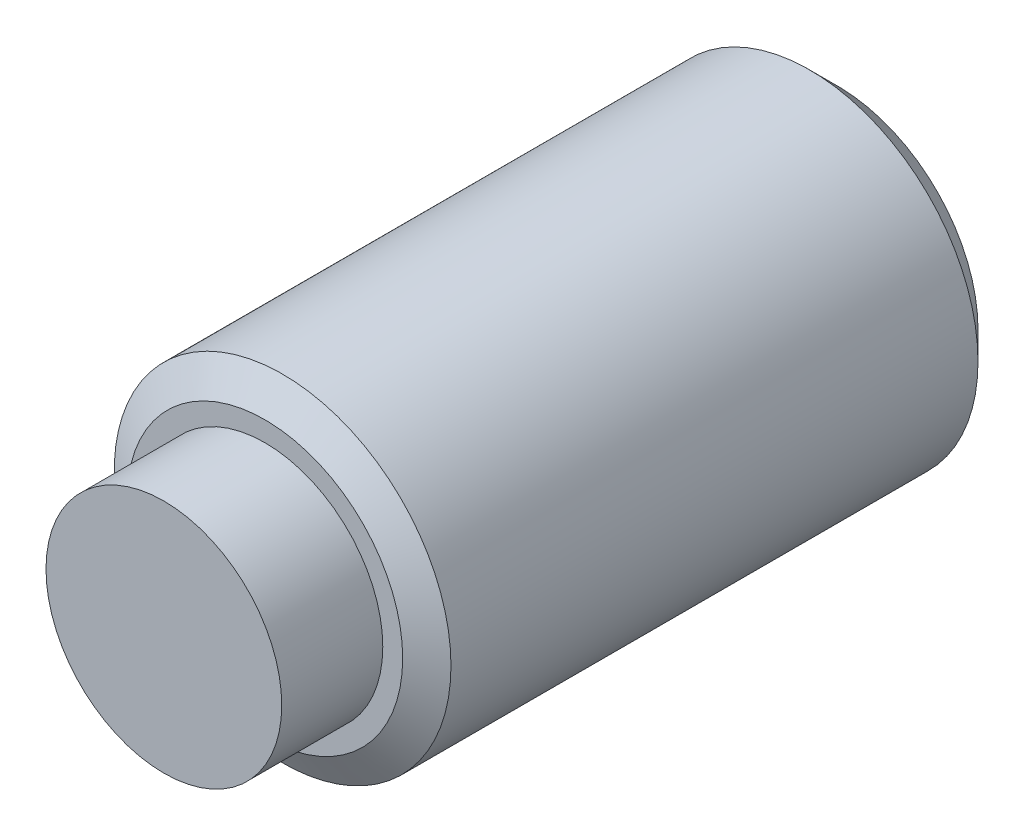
ISO-10303-21;
HEADER;
FILE_DESCRIPTION(('STEP AP214'),'2;1');
FILE_NAME('part.step','',(''),(''),'','','');
FILE_SCHEMA(('AUTOMOTIVE_DESIGN { 1 0 10303 214 1 1 1 1 }'));
ENDSEC;
DATA;
#1=APPLICATION_CONTEXT('core data for automotive mechanical design processes');
#2=APPLICATION_PROTOCOL_DEFINITION('international standard','automotive_design',2000,#1);
#3=PRODUCT_CONTEXT('',#1,'mechanical');
#4=PRODUCT('Part','Part','',(#3));
#5=PRODUCT_RELATED_PRODUCT_CATEGORY('part','',(#4));
#6=PRODUCT_DEFINITION_FORMATION('','',#4);
#7=PRODUCT_DEFINITION_CONTEXT('part definition',#1,'design');
#8=PRODUCT_DEFINITION('design','',#6,#7);
#9=PRODUCT_DEFINITION_SHAPE('','',#8);
#10=(LENGTH_UNIT() NAMED_UNIT(*) SI_UNIT(.MILLI.,.METRE.));
#11=(NAMED_UNIT(*) PLANE_ANGLE_UNIT() SI_UNIT($,.RADIAN.));
#12=(NAMED_UNIT(*) SI_UNIT($,.STERADIAN.) SOLID_ANGLE_UNIT());
#13=UNCERTAINTY_MEASURE_WITH_UNIT(LENGTH_MEASURE(1.E-05),#10,'distance_accuracy_value','');
#14=(GEOMETRIC_REPRESENTATION_CONTEXT(3) GLOBAL_UNCERTAINTY_ASSIGNED_CONTEXT((#13)) GLOBAL_UNIT_ASSIGNED_CONTEXT((#10,
#11,#12)) REPRESENTATION_CONTEXT('',''));
#15=CARTESIAN_POINT('',(0.,0.,0.));
#16=DIRECTION('',(0.,0.,1.));
#17=DIRECTION('',(1.,0.,0.));
#18=AXIS2_PLACEMENT_3D('',#15,#16,#17);
#19=CARTESIAN_POINT('',(0.,0.,10.));
#20=DIRECTION('',(0.,0.,-1.));
#21=DIRECTION('',(-1.,0.,0.));
#22=AXIS2_PLACEMENT_3D('',#19,#20,#21);
#23=CYLINDRICAL_SURFACE('',#22,2.5);
#24=CARTESIAN_POINT('',(0.,0.,8.23753333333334));
#25=DIRECTION('',(0.,0.,1.));
#26=DIRECTION('',(1.,0.,0.));
#27=AXIS2_PLACEMENT_3D('',#24,#25,#26);
#28=CIRCLE('',#27,2.5);
#29=CARTESIAN_POINT('',(2.5,0.,8.23753333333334));
#30=VERTEX_POINT('',#29);
#31=EDGE_CURVE('E11',#30,#30,#28,.F.);
#32=ORIENTED_EDGE('',*,*,#31,.T.);
#33=EDGE_LOOP('',(#32));
#34=FACE_BOUND('',#33,.T.);
#35=CARTESIAN_POINT('',(0.,0.,0.41333333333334));
#36=DIRECTION('',(0.,0.,1.));
#37=DIRECTION('',(1.,0.,0.));
#38=AXIS2_PLACEMENT_3D('',#35,#36,#37);
#39=CIRCLE('',#38,2.5);
#40=CARTESIAN_POINT('',(2.5,0.,0.41333333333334));
#41=VERTEX_POINT('',#40);
#42=EDGE_CURVE('E160',#41,#41,#39,.T.);
#43=ORIENTED_EDGE('',*,*,#42,.T.);
#44=EDGE_LOOP('',(#43));
#45=FACE_BOUND('',#44,.T.);
#46=ADVANCED_FACE('F42',(#34,#45),#23,.T.);
#47=CARTESIAN_POINT('',(0.,0.,0.));
#48=DIRECTION('',(0.,0.,1.));
#49=DIRECTION('',(1.,0.,0.));
#50=AXIS2_PLACEMENT_3D('',#47,#48,#49);
#51=PLANE('',#50);
#52=CARTESIAN_POINT('',(0.,0.,0.));
#53=DIRECTION('',(0.,0.,1.));
#54=DIRECTION('',(1.,0.,0.));
#55=AXIS2_PLACEMENT_3D('',#52,#53,#54);
#56=CIRCLE('',#55,2.08666666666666);
#57=CARTESIAN_POINT('',(2.08666666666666,0.,0.));
#58=VERTEX_POINT('',#57);
#59=EDGE_CURVE('E171',#58,#58,#56,.F.);
#60=ORIENTED_EDGE('',*,*,#59,.T.);
#61=EDGE_LOOP('',(#60));
#62=FACE_BOUND('',#61,.T.);
#63=DIRECTION('',(-0.866025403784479,-0.499999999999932,0.));
#64=VECTOR('',#63,1.);
#65=CARTESIAN_POINT('',(0.,1.45492267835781,0.));
#66=LINE('',#65,#64);
#67=CARTESIAN_POINT('',(0.,1.45492267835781,0.));
#68=VERTEX_POINT('',#67);
#69=CARTESIAN_POINT('',(-1.26000000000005,0.727461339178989,0.));
#70=VERTEX_POINT('',#69);
#71=EDGE_CURVE('E145',#68,#70,#66,.T.);
#72=ORIENTED_EDGE('',*,*,#71,.T.);
#73=DIRECTION('',(0.,1.,0.));
#74=VECTOR('',#73,1.);
#75=CARTESIAN_POINT('',(-1.26000000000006,-0.727461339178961,0.));
#76=LINE('',#75,#74);
#77=CARTESIAN_POINT('',(-1.26000000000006,-0.727461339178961,0.));
#78=VERTEX_POINT('',#77);
#79=EDGE_CURVE('E58',#78,#70,#76,.T.);
#80=ORIENTED_EDGE('',*,*,#79,.F.);
#81=DIRECTION('',(-0.866025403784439,0.500000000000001,0.));
#82=VECTOR('',#81,1.);
#83=CARTESIAN_POINT('',(0.,-1.45492267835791,0.));
#84=LINE('',#83,#82);
#85=CARTESIAN_POINT('',(0.,-1.45492267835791,0.));
#86=VERTEX_POINT('',#85);
#87=EDGE_CURVE('E155',#86,#78,#84,.T.);
#88=ORIENTED_EDGE('',*,*,#87,.F.);
#89=DIRECTION('',(0.866025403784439,0.5,0.));
#90=VECTOR('',#89,1.);
#91=CARTESIAN_POINT('',(0.,-1.45492267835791,0.));
#92=LINE('',#91,#90);
#93=CARTESIAN_POINT('',(1.26000000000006,-0.727461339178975,0.));
#94=VERTEX_POINT('',#93);
#95=EDGE_CURVE('E153',#86,#94,#92,.T.);
#96=ORIENTED_EDGE('',*,*,#95,.T.);
#97=DIRECTION('',(0.,1.,0.));
#98=VECTOR('',#97,1.);
#99=CARTESIAN_POINT('',(1.26000000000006,-0.727461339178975,0.));
#100=LINE('',#99,#98);
#101=CARTESIAN_POINT('',(1.26000000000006,0.727461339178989,0.));
#102=VERTEX_POINT('',#101);
#103=EDGE_CURVE('E124',#94,#102,#100,.T.);
#104=ORIENTED_EDGE('',*,*,#103,.T.);
#105=DIRECTION('',(0.866025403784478,-0.499999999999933,0.));
#106=VECTOR('',#105,1.);
#107=CARTESIAN_POINT('',(0.,1.45492267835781,0.));
#108=LINE('',#107,#106);
#109=EDGE_CURVE('E149',#68,#102,#108,.T.);
#110=ORIENTED_EDGE('',*,*,#109,.F.);
#111=EDGE_LOOP('',(#72,#80,#88,#96,#104,#110));
#112=FACE_BOUND('',#111,.T.);
#113=ADVANCED_FACE('F192',(#62,#112),#51,.F.);
#114=CARTESIAN_POINT('',(-1.26000000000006,-0.727461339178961,1.27));
#115=DIRECTION('',(-1.,0.,0.));
#116=DIRECTION('',(0.,0.,1.));
#117=AXIS2_PLACEMENT_3D('',#114,#115,#116);
#118=PLANE('',#117);
#119=ORIENTED_EDGE('',*,*,#79,.T.);
#120=DIRECTION('',(0.,0.,-1.));
#121=VECTOR('',#120,1.);
#122=CARTESIAN_POINT('',(-1.26000000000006,0.727461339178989,1.27));
#123=LINE('',#122,#121);
#124=CARTESIAN_POINT('',(-1.26000000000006,0.727461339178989,1.27));
#125=VERTEX_POINT('',#124);
#126=EDGE_CURVE('E143',#125,#70,#123,.T.);
#127=ORIENTED_EDGE('',*,*,#126,.F.);
#128=DIRECTION('',(0.,1.,0.));
#129=VECTOR('',#128,1.);
#130=CARTESIAN_POINT('',(-1.26000000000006,-0.727461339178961,1.27));
#131=LINE('',#130,#129);
#132=CARTESIAN_POINT('',(-1.26000000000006,-0.727461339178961,1.27));
#133=VERTEX_POINT('',#132);
#134=EDGE_CURVE('E157',#133,#125,#131,.T.);
#135=ORIENTED_EDGE('',*,*,#134,.F.);
#136=DIRECTION('',(0.,0.,-1.));
#137=VECTOR('',#136,1.);
#138=CARTESIAN_POINT('',(-1.26000000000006,-0.727461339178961,1.27));
#139=LINE('',#138,#137);
#140=EDGE_CURVE('E68',#133,#78,#139,.T.);
#141=ORIENTED_EDGE('',*,*,#140,.T.);
#142=EDGE_LOOP('',(#119,#127,#135,#141));
#143=FACE_BOUND('',#142,.T.);
#144=ADVANCED_FACE('F198',(#143),#118,.F.);
#145=CARTESIAN_POINT('',(0.,-1.45492267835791,1.27));
#146=DIRECTION('',(-0.500000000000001,-0.866025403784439,0.));
#147=DIRECTION('',(0.866025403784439,-0.500000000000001,0.));
#148=AXIS2_PLACEMENT_3D('',#145,#146,#147);
#149=PLANE('',#148);
#150=ORIENTED_EDGE('',*,*,#87,.T.);
#151=ORIENTED_EDGE('',*,*,#140,.F.);
#152=DIRECTION('',(-0.866025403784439,0.500000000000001,0.));
#153=VECTOR('',#152,1.);
#154=CARTESIAN_POINT('',(0.,-1.45492267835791,1.27));
#155=LINE('',#154,#153);
#156=CARTESIAN_POINT('',(0.,-1.45492267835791,1.27));
#157=VERTEX_POINT('',#156);
#158=EDGE_CURVE('E117',#157,#133,#155,.T.);
#159=ORIENTED_EDGE('',*,*,#158,.F.);
#160=DIRECTION('',(0.,0.,-1.));
#161=VECTOR('',#160,1.);
#162=CARTESIAN_POINT('',(0.,-1.45492267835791,1.27));
#163=LINE('',#162,#161);
#164=EDGE_CURVE('E112',#157,#86,#163,.T.);
#165=ORIENTED_EDGE('',*,*,#164,.T.);
#166=EDGE_LOOP('',(#150,#151,#159,#165));
#167=FACE_BOUND('',#166,.T.);
#168=ADVANCED_FACE('F237',(#167),#149,.F.);
#169=CARTESIAN_POINT('',(0.,-1.45492267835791,1.27));
#170=DIRECTION('',(-0.5,0.866025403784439,0.));
#171=DIRECTION('',(-0.866025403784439,-0.500000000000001,0.));
#172=AXIS2_PLACEMENT_3D('',#169,#170,#171);
#173=PLANE('',#172);
#174=ORIENTED_EDGE('',*,*,#95,.F.);
#175=ORIENTED_EDGE('',*,*,#164,.F.);
#176=DIRECTION('',(0.866025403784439,0.5,0.));
#177=VECTOR('',#176,1.);
#178=CARTESIAN_POINT('',(0.,-1.45492267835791,1.27));
#179=LINE('',#178,#177);
#180=CARTESIAN_POINT('',(1.26000000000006,-0.727461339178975,1.27));
#181=VERTEX_POINT('',#180);
#182=EDGE_CURVE('E106',#157,#181,#179,.T.);
#183=ORIENTED_EDGE('',*,*,#182,.T.);
#184=DIRECTION('',(0.,0.,-1.));
#185=VECTOR('',#184,1.);
#186=CARTESIAN_POINT('',(1.26000000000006,-0.727461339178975,1.27));
#187=LINE('',#186,#185);
#188=EDGE_CURVE('E110',#181,#94,#187,.T.);
#189=ORIENTED_EDGE('',*,*,#188,.T.);
#190=EDGE_LOOP('',(#174,#175,#183,#189));
#191=FACE_BOUND('',#190,.T.);
#192=ADVANCED_FACE('F109',(#191),#173,.T.);
#193=CARTESIAN_POINT('',(1.26000000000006,-0.727461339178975,1.27));
#194=DIRECTION('',(-1.,0.,0.));
#195=DIRECTION('',(0.,0.,1.));
#196=AXIS2_PLACEMENT_3D('',#193,#194,#195);
#197=PLANE('',#196);
#198=ORIENTED_EDGE('',*,*,#103,.F.);
#199=ORIENTED_EDGE('',*,*,#188,.F.);
#200=DIRECTION('',(0.,1.,0.));
#201=VECTOR('',#200,1.);
#202=CARTESIAN_POINT('',(1.26000000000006,-0.727461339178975,1.27));
#203=LINE('',#202,#201);
#204=CARTESIAN_POINT('',(1.26000000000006,0.727461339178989,1.27));
#205=VERTEX_POINT('',#204);
#206=EDGE_CURVE('E118',#181,#205,#203,.T.);
#207=ORIENTED_EDGE('',*,*,#206,.T.);
#208=DIRECTION('',(0.,0.,-1.));
#209=VECTOR('',#208,1.);
#210=CARTESIAN_POINT('',(1.26000000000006,0.727461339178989,1.27));
#211=LINE('',#210,#209);
#212=EDGE_CURVE('E127',#205,#102,#211,.T.);
#213=ORIENTED_EDGE('',*,*,#212,.T.);
#214=EDGE_LOOP('',(#198,#199,#207,#213));
#215=FACE_BOUND('',#214,.T.);
#216=ADVANCED_FACE('F121',(#215),#197,.T.);
#217=CARTESIAN_POINT('',(0.,1.45492267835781,1.27));
#218=DIRECTION('',(0.499999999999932,0.866025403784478,0.));
#219=DIRECTION('',(-0.866025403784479,0.499999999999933,0.));
#220=AXIS2_PLACEMENT_3D('',#217,#218,#219);
#221=PLANE('',#220);
#222=ORIENTED_EDGE('',*,*,#109,.T.);
#223=ORIENTED_EDGE('',*,*,#212,.F.);
#224=DIRECTION('',(0.866025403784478,-0.499999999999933,0.));
#225=VECTOR('',#224,1.);
#226=CARTESIAN_POINT('',(0.,1.45492267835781,1.27));
#227=LINE('',#226,#225);
#228=CARTESIAN_POINT('',(0.,1.45492267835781,1.27));
#229=VERTEX_POINT('',#228);
#230=EDGE_CURVE('E133',#229,#205,#227,.T.);
#231=ORIENTED_EDGE('',*,*,#230,.F.);
#232=DIRECTION('',(0.,0.,-1.));
#233=VECTOR('',#232,1.);
#234=CARTESIAN_POINT('',(0.,1.45492267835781,1.27));
#235=LINE('',#234,#233);
#236=EDGE_CURVE('E164',#229,#68,#235,.T.);
#237=ORIENTED_EDGE('',*,*,#236,.T.);
#238=EDGE_LOOP('',(#222,#223,#231,#237));
#239=FACE_BOUND('',#238,.T.);
#240=ADVANCED_FACE('F244',(#239),#221,.F.);
#241=CARTESIAN_POINT('',(0.,1.45492267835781,1.27));
#242=DIRECTION('',(0.499999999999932,-0.866025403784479,0.));
#243=DIRECTION('',(0.866025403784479,0.499999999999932,0.));
#244=AXIS2_PLACEMENT_3D('',#241,#242,#243);
#245=PLANE('',#244);
#246=ORIENTED_EDGE('',*,*,#71,.F.);
#247=ORIENTED_EDGE('',*,*,#236,.F.);
#248=DIRECTION('',(-0.866025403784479,-0.499999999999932,0.));
#249=VECTOR('',#248,1.);
#250=CARTESIAN_POINT('',(0.,1.45492267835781,1.27));
#251=LINE('',#250,#249);
#252=EDGE_CURVE('E95',#229,#125,#251,.T.);
#253=ORIENTED_EDGE('',*,*,#252,.T.);
#254=ORIENTED_EDGE('',*,*,#126,.T.);
#255=EDGE_LOOP('',(#246,#247,#253,#254));
#256=FACE_BOUND('',#255,.T.);
#257=ADVANCED_FACE('F210',(#256),#245,.T.);
#258=CARTESIAN_POINT('',(-1.26000000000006,0.727461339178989,1.27));
#259=DIRECTION('',(0.,0.,1.));
#260=DIRECTION('',(1.,0.,0.));
#261=AXIS2_PLACEMENT_3D('',#258,#259,#260);
#262=PLANE('',#261);
#263=ORIENTED_EDGE('',*,*,#134,.T.);
#264=ORIENTED_EDGE('',*,*,#252,.F.);
#265=ORIENTED_EDGE('',*,*,#230,.T.);
#266=ORIENTED_EDGE('',*,*,#206,.F.);
#267=ORIENTED_EDGE('',*,*,#182,.F.);
#268=ORIENTED_EDGE('',*,*,#158,.T.);
#269=EDGE_LOOP('',(#263,#264,#265,#266,#267,#268));
#270=FACE_BOUND('',#269,.T.);
#271=ADVANCED_FACE('F131',(#270),#262,.F.);
#272=CARTESIAN_POINT('',(0.,0.,0.41333333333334));
#273=DIRECTION('',(0.,0.,1.));
#274=DIRECTION('',(1.,0.,0.));
#275=AXIS2_PLACEMENT_3D('',#272,#273,#274);
#276=CONICAL_SURFACE('',#275,2.5,0.785398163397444);
#277=CARTESIAN_POINT('',(2.08666666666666,0.,0.));
#278=CARTESIAN_POINT('',(2.09097222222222,0.,0.00430555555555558));
#279=CARTESIAN_POINT('',(2.09527777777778,0.,0.0086111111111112));
#280=CARTESIAN_POINT('',(2.10388888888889,0.,0.0172222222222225));
#281=CARTESIAN_POINT('',(2.10819444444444,0.,0.0215277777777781));
#282=CARTESIAN_POINT('',(2.11680555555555,0.,0.0301388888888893));
#283=CARTESIAN_POINT('',(2.12111111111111,0.,0.034444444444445));
#284=CARTESIAN_POINT('',(2.12972222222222,0.,0.0430555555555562));
#285=CARTESIAN_POINT('',(2.13402777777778,0.,0.0473611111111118));
#286=CARTESIAN_POINT('',(2.14263888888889,0.,0.0559722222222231));
#287=CARTESIAN_POINT('',(2.14694444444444,0.,0.0602777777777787));
#288=CARTESIAN_POINT('',(2.15555555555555,0.,0.06888888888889));
#289=CARTESIAN_POINT('',(2.15986111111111,0.,0.0731944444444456));
#290=CARTESIAN_POINT('',(2.16847222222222,0.,0.0818055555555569));
#291=CARTESIAN_POINT('',(2.17277777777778,0.,0.0861111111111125));
#292=CARTESIAN_POINT('',(2.18138888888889,0.,0.0947222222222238));
#293=CARTESIAN_POINT('',(2.18569444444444,0.,0.0990277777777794));
#294=CARTESIAN_POINT('',(2.19430555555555,0.,0.107638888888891));
#295=CARTESIAN_POINT('',(2.19861111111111,0.,0.111944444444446));
#296=CARTESIAN_POINT('',(2.20722222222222,0.,0.120555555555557));
#297=CARTESIAN_POINT('',(2.21152777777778,0.,0.124861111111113));
#298=CARTESIAN_POINT('',(2.22013888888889,0.,0.133472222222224));
#299=CARTESIAN_POINT('',(2.22444444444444,0.,0.13777777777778));
#300=CARTESIAN_POINT('',(2.23305555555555,0.,0.146388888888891));
#301=CARTESIAN_POINT('',(2.23736111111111,0.,0.150694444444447));
#302=CARTESIAN_POINT('',(2.24597222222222,0.,0.159305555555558));
#303=CARTESIAN_POINT('',(2.25027777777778,0.,0.163611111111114));
#304=CARTESIAN_POINT('',(2.25888888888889,0.,0.172222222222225));
#305=CARTESIAN_POINT('',(2.26319444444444,0.,0.176527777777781));
#306=CARTESIAN_POINT('',(2.27180555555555,0.,0.185138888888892));
#307=CARTESIAN_POINT('',(2.27611111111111,0.,0.189444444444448));
#308=CARTESIAN_POINT('',(2.28472222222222,0.,0.198055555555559));
#309=CARTESIAN_POINT('',(2.28902777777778,0.,0.202361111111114));
#310=CARTESIAN_POINT('',(2.29763888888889,0.,0.210972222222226));
#311=CARTESIAN_POINT('',(2.30194444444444,0.,0.215277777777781));
#312=CARTESIAN_POINT('',(2.31055555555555,0.,0.223888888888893));
#313=CARTESIAN_POINT('',(2.31486111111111,0.,0.228194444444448));
#314=CARTESIAN_POINT('',(2.32347222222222,0.,0.236805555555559));
#315=CARTESIAN_POINT('',(2.32777777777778,0.,0.241111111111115));
#316=CARTESIAN_POINT('',(2.33638888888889,0.,0.249722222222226));
#317=CARTESIAN_POINT('',(2.34069444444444,0.,0.254027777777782));
#318=CARTESIAN_POINT('',(2.34930555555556,0.,0.262638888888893));
#319=CARTESIAN_POINT('',(2.35361111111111,0.,0.266944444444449));
#320=CARTESIAN_POINT('',(2.36222222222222,0.,0.27555555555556));
#321=CARTESIAN_POINT('',(2.36652777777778,0.,0.279861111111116));
#322=CARTESIAN_POINT('',(2.37513888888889,0.,0.288472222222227));
#323=CARTESIAN_POINT('',(2.37944444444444,0.,0.292777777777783));
#324=CARTESIAN_POINT('',(2.38805555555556,0.,0.301388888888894));
#325=CARTESIAN_POINT('',(2.39236111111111,0.,0.305694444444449));
#326=CARTESIAN_POINT('',(2.40097222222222,0.,0.314305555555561));
#327=CARTESIAN_POINT('',(2.40527777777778,0.,0.318611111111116));
#328=CARTESIAN_POINT('',(2.41388888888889,0.,0.327222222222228));
#329=CARTESIAN_POINT('',(2.41819444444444,0.,0.331527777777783));
#330=CARTESIAN_POINT('',(2.42680555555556,0.,0.340138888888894));
#331=CARTESIAN_POINT('',(2.43111111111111,0.,0.34444444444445));
#332=CARTESIAN_POINT('',(2.43972222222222,0.,0.353055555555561));
#333=CARTESIAN_POINT('',(2.44402777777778,0.,0.357361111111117));
#334=CARTESIAN_POINT('',(2.45263888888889,0.,0.365972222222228));
#335=CARTESIAN_POINT('',(2.45694444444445,0.,0.370277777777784));
#336=CARTESIAN_POINT('',(2.46555555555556,0.,0.378888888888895));
#337=CARTESIAN_POINT('',(2.46986111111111,0.,0.383194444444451));
#338=CARTESIAN_POINT('',(2.47847222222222,0.,0.391805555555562));
#339=CARTESIAN_POINT('',(2.48277777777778,0.,0.396111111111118));
#340=CARTESIAN_POINT('',(2.49138888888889,0.,0.404722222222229));
#341=CARTESIAN_POINT('',(2.49569444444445,0.,0.409027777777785));
#342=CARTESIAN_POINT('',(2.5,0.,0.41333333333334));
#343=B_SPLINE_CURVE_WITH_KNOTS('',3,(#277,#278,#279,#280,#281,#282,#283,#284,#285,#286,#287,
#288,#289,#290,#291,#292,#293,#294,#295,#296,#297,#298,#299,#300,#301,#302,#303,#304,#305,#306,
#307,#308,#309,#310,#311,#312,#313,#314,#315,#316,#317,#318,#319,#320,#321,#322,#323,#324,#325,
#326,#327,#328,#329,#330,#331,#332,#333,#334,#335,#336,#337,#338,#339,#340,#341,#342),
.UNSPECIFIED.,.F.,.F.,(4,2,2,2,2,2,2,2,2,2,2,2,2,2,2,2,2,2,2,2,2,2,2,2,2,2,2,2,2,2,2,2,4),(0.,
0.0182669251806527,0.0365338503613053,0.054800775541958,0.0730677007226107,0.0913346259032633,
0.109601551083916,0.127868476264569,0.146135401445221,0.164402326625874,0.182669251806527,
0.20093617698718,0.219203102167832,0.237470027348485,0.255736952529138,0.27400387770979,
0.292270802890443,0.310537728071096,0.328804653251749,0.347071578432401,0.365338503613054,
0.383605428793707,0.401872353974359,0.420139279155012,0.438406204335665,0.456673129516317,
0.47494005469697,0.493206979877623,0.511473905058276,0.529740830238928,0.548007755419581,
0.566274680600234,0.584541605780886),.UNSPECIFIED.);
#344=EDGE_CURVE('BSEAM202',#58,#41,#343,.T.);
#345=ORIENTED_EDGE('',*,*,#59,.F.);
#346=ORIENTED_EDGE('',*,*,#42,.F.);
#347=ORIENTED_EDGE('',*,*,#344,.T.);
#348=ORIENTED_EDGE('',*,*,#344,.F.);
#349=EDGE_LOOP('',(#345,#347,#346,#348));
#350=FACE_BOUND('',#349,.T.);
#351=ADVANCED_FACE('F202',(#350),#276,.T.);
#352=CARTESIAN_POINT('',(0.,0.,8.5));
#353=DIRECTION('',(0.,0.,1.));
#354=DIRECTION('',(1.,0.,0.));
#355=AXIS2_PLACEMENT_3D('',#352,#353,#354);
#356=PLANE('',#355);
#357=CARTESIAN_POINT('',(0.,0.,8.5));
#358=DIRECTION('',(0.,0.,1.));
#359=DIRECTION('',(1.,0.,0.));
#360=AXIS2_PLACEMENT_3D('',#357,#358,#359);
#361=CIRCLE('',#360,2.04539439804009);
#362=CARTESIAN_POINT('',(2.04539439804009,0.,8.5));
#363=VERTEX_POINT('',#362);
#364=EDGE_CURVE('E51',#363,#363,#361,.T.);
#365=ORIENTED_EDGE('',*,*,#364,.T.);
#366=EDGE_LOOP('',(#365));
#367=FACE_BOUND('',#366,.T.);
#368=CARTESIAN_POINT('',(0.,0.,8.5));
#369=DIRECTION('',(0.,0.,1.));
#370=DIRECTION('',(1.,0.,0.));
#371=AXIS2_PLACEMENT_3D('',#368,#369,#370);
#372=CIRCLE('',#371,1.75);
#373=CARTESIAN_POINT('',(1.75,0.,8.5));
#374=VERTEX_POINT('',#373);
#375=EDGE_CURVE('E146',#374,#374,#372,.T.);
#376=ORIENTED_EDGE('',*,*,#375,.F.);
#377=EDGE_LOOP('',(#376));
#378=FACE_BOUND('',#377,.T.);
#379=ADVANCED_FACE('F178',(#367,#378),#356,.T.);
#380=CARTESIAN_POINT('',(0.,0.,8.5));
#381=DIRECTION('',(0.,0.,1.));
#382=DIRECTION('',(1.,0.,0.));
#383=AXIS2_PLACEMENT_3D('',#380,#381,#382);
#384=CYLINDRICAL_SURFACE('',#383,1.75);
#385=ORIENTED_EDGE('',*,*,#375,.T.);
#386=EDGE_LOOP('',(#385));
#387=FACE_BOUND('',#386,.T.);
#388=CARTESIAN_POINT('',(0.,0.,10.));
#389=DIRECTION('',(0.,0.,1.));
#390=DIRECTION('',(1.,0.,0.));
#391=AXIS2_PLACEMENT_3D('',#388,#389,#390);
#392=CIRCLE('',#391,1.75);
#393=CARTESIAN_POINT('',(1.75,0.,10.));
#394=VERTEX_POINT('',#393);
#395=EDGE_CURVE('E223',#394,#394,#392,.T.);
#396=ORIENTED_EDGE('',*,*,#395,.F.);
#397=EDGE_LOOP('',(#396));
#398=FACE_BOUND('',#397,.T.);
#399=ADVANCED_FACE('F187',(#387,#398),#384,.T.);
#400=CARTESIAN_POINT('',(0.,0.,10.));
#401=DIRECTION('',(0.,0.,1.));
#402=DIRECTION('',(1.,0.,0.));
#403=AXIS2_PLACEMENT_3D('',#400,#401,#402);
#404=PLANE('',#403);
#405=ORIENTED_EDGE('',*,*,#395,.T.);
#406=EDGE_LOOP('',(#405));
#407=FACE_BOUND('',#406,.T.);
#408=ADVANCED_FACE('F182',(#407),#404,.T.);
#409=CARTESIAN_POINT('',(0.,0.,8.5));
#410=DIRECTION('',(0.,0.,-1.));
#411=DIRECTION('',(-1.,0.,0.));
#412=AXIS2_PLACEMENT_3D('',#409,#410,#411);
#413=CONICAL_SURFACE('',#412,2.04539439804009,1.0471975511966);
#414=ORIENTED_EDGE('',*,*,#31,.F.);
#415=EDGE_LOOP('',(#414));
#416=FACE_BOUND('',#415,.T.);
#417=ORIENTED_EDGE('',*,*,#364,.F.);
#418=EDGE_LOOP('',(#417));
#419=FACE_BOUND('',#418,.T.);
#420=ADVANCED_FACE('F44',(#416,#419),#413,.T.);
#421=CLOSED_SHELL('',(#46,#113,#144,#168,#192,#216,#240,#257,#271,#351,#379,#399,#408,#420));
#422=MANIFOLD_SOLID_BREP('B2',#421);
#423=ADVANCED_BREP_SHAPE_REPRESENTATION('',(#18,#422),#14);
#424=SHAPE_DEFINITION_REPRESENTATION(#9,#423);
ENDSEC;
END-ISO-10303-21;
